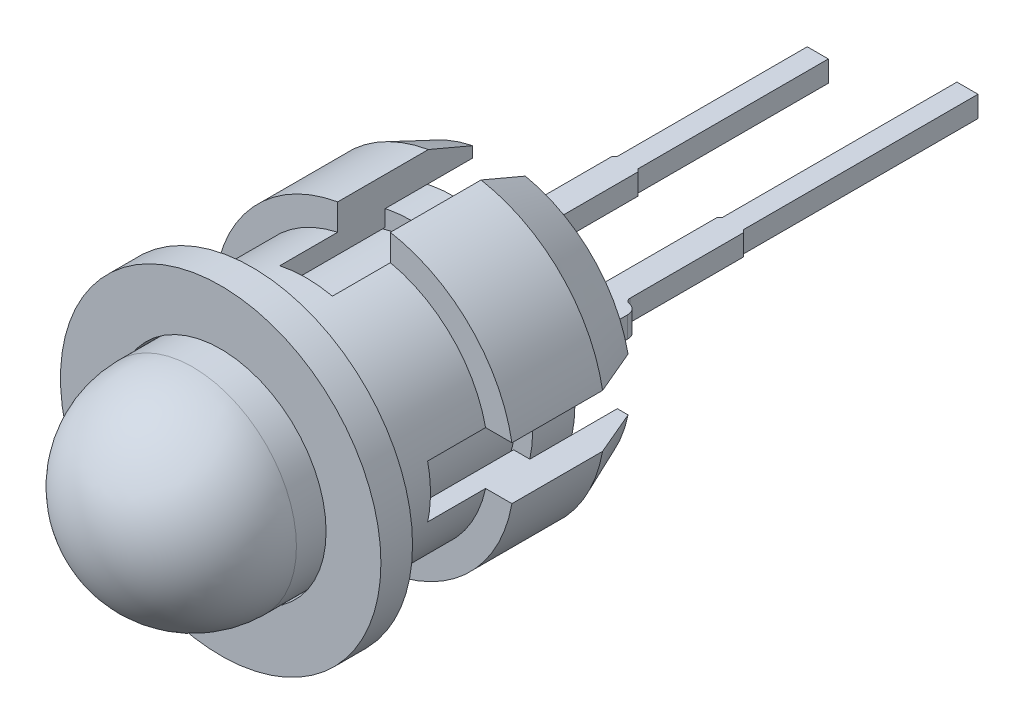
from build123d import *

# Parameters (mm, degrees)
EXTRUDE1_DEPTH          = 0.254
EXTRUDE1_DEPTH_BACK     = 0.254
CUT_EXTRUDE_THIN2_START = -13.380239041
SKETCH5_W               = 1.27
SKETCH5_H               = 8.860157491
CUT_EXTRUDE_THIN2_DEPTH = 16.936239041
CIRPATTERN2_COUNT       = 2
CIRPATTERN2_ANGLE       = 90


with BuildPart() as part:
    # Sketch1 → Revolve1 (revolve)
    with BuildSketch(Plane(origin=(0, 0, 0), x_dir=(0, 0, -1), z_dir=(1, 0, 0)), mode=Mode.PRIVATE) as revolve1_sk:
        with BuildLine():
            Line((0, 0), (0, 2.921))
            Line((0, 2.921), (-1.016, 2.921))
            Line((-1.016, 2.921), (-1.016, 2.5))
            Line((-1.016, 2.5), (-6.2884, 2.5))
            ThreePointArc((-6.2884, 2.5), (-8.056166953, 1.767766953), (-8.7884, 0))
            Line((-8.7884, 0), (0, 0))
        make_face()
    revolve(revolve1_sk.sketch.rotate(Axis((0, 0, 68.7324), (0, 0, -1)), 90), axis=Axis((0, 0, 68.7324), (0, 0, -1)))

    # Sketch3 → Extrude1 (add, two sides: drawn at the far end of the back side and taken through both)
    with BuildSketch(Plane(origin=(0, 0, 0), x_dir=(1, 0, 0), z_dir=(0, 1, 0)).offset(-EXTRUDE1_DEPTH_BACK)):
        with BuildLine():
            Line((0.8382, 0), (1.7018, 0))
            Line((1.7018, 0), (1.7018, 1.740996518))
            ThreePointArc((1.7018, 1.740996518), (1.720043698, 1.806579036), (1.769533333, 1.853319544))
            ThreePointArc((1.769533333, 1.853319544), (1.868512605, 1.946800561), (1.905, 2.077965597))
            Line((1.905, 2.077965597), (1.905, 2.289552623))
            ThreePointArc((1.905, 2.289552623), (1.844995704, 2.453508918), (1.693333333, 2.54))
            ThreePointArc((1.693333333, 2.54), (1.617502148, 2.583245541), (1.5875, 2.665223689))
            Line((1.5875, 2.665223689), (1.5875, 5.3975))
            Line((1.5875, 5.3975), (1.524, 5.461))
            Line((1.524, 5.461), (1.524, 11.1112))
            Line((1.524, 11.1112), (1.016, 11.1112))
            Line((1.016, 11.1112), (1.016, 5.461))
            Line((1.016, 5.461), (0.9525, 5.3975))
            Line((0.9525, 5.3975), (0.9525, 2.665223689))
            ThreePointArc((0.9525, 2.665223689), (0.922497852, 2.583245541), (0.846666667, 2.54))
            ThreePointArc((0.846666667, 2.54), (0.695004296, 2.453508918), (0.635, 2.289552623))
            Line((0.635, 2.289552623), (0.635, 2.077965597))
            ThreePointArc((0.635, 2.077965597), (0.671487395, 1.946800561), (0.770466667, 1.853319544))
            ThreePointArc((0.770466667, 1.853319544), (0.819956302, 1.806579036), (0.8382, 1.740996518))
            Line((0.8382, 1.740996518), (0.8382, 0))
        make_face()
        with BuildLine():
            Line((-1.5875, 5.3975), (-1.524, 5.461))
            Line((-1.524, 5.461), (-1.524, 10.0444))
            Line((-1.524, 10.0444), (-1.016, 10.0444))
            Line((-1.016, 10.0444), (-1.016, 5.461))
            Line((-1.016, 5.461), (-0.9525, 5.3975))
            Line((-0.9525, 5.3975), (-0.9525, 2.665223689))
            ThreePointArc((-0.9525, 2.665223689), (-0.922497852, 2.583245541), (-0.846666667, 2.54))
            ThreePointArc((-0.846666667, 2.54), (-0.695004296, 2.453508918), (-0.635, 2.289552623))
            Line((-0.635, 2.289552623), (-0.635, 2.077965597))
            ThreePointArc((-0.635, 2.077965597), (-0.671487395, 1.946800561), (-0.770466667, 1.853319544))
            ThreePointArc((-0.770466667, 1.853319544), (-0.819956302, 1.806579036), (-0.8382, 1.740996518))
            Line((-0.8382, 1.740996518), (-0.8382, 0))
            Line((-0.8382, 0), (-1.7018, 0))
            Line((-1.7018, 0), (-1.7018, 1.740996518))
            ThreePointArc((-1.7018, 1.740996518), (-1.720043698, 1.806579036), (-1.769533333, 1.853319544))
            ThreePointArc((-1.769533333, 1.853319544), (-1.868512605, 1.946800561), (-1.905, 2.077965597))
            Line((-1.905, 2.077965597), (-1.905, 2.289552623))
            ThreePointArc((-1.905, 2.289552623), (-1.844995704, 2.453508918), (-1.693333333, 2.54))
            ThreePointArc((-1.693333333, 2.54), (-1.617502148, 2.583245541), (-1.5875, 2.665223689))
            Line((-1.5875, 2.665223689), (-1.5875, 5.3975))
        make_face()
    extrude(amount=EXTRUDE1_DEPTH + EXTRUDE1_DEPTH_BACK)


with BuildPart() as body_2:
    # Sketch4 → Revolve3 (revolve)
    with BuildSketch(Plane(origin=(0, 0, 0), x_dir=(0, 0, -1), z_dir=(1, 0, 0)), mode=Mode.PRIVATE) as revolve3_sk:
        Polygon((1.0922, 2.921), (-1.016, 2.921), (-1.016, 2.54), (-5.6134, 2.54), (-5.6134, 3.8608), (-4.8514, 3.8608), (-4.8514, 2.9972), (-2.159, 2.9972), (-2.159, 3.6195), (0.0254, 3.6195), (1.0922, 3.175), align=None)
    revolve(revolve3_sk.sketch.rotate(Axis((0, 0, 10.223161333), (0, 0, -1)), 90), axis=Axis((0, 0, 10.223161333), (0, 0, -1)))

    # Sketch5 → Cut-Extrude-Thin2 (cut)
    with BuildSketch(Plane.XY.offset(CUT_EXTRUDE_THIN2_START)):
        with Locations((0, -0.066617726)):
            Rectangle(SKETCH5_W, SKETCH5_H)
    cut_extrude_thin2 = extrude(amount=CUT_EXTRUDE_THIN2_DEPTH, mode=Mode.SUBTRACT)

    # CirPattern2: Cut-Extrude-Thin2 ×2 about axis
    cirpattern2_axis = Axis((0, 0, 68.7324), (0, 0, -1))
    for i in range(1, CIRPATTERN2_COUNT):
        add(cut_extrude_thin2.rotate(cirpattern2_axis, i * CIRPATTERN2_ANGLE / (CIRPATTERN2_COUNT - 1)), mode=Mode.SUBTRACT)


solid = Compound([part.part, body_2.part])
